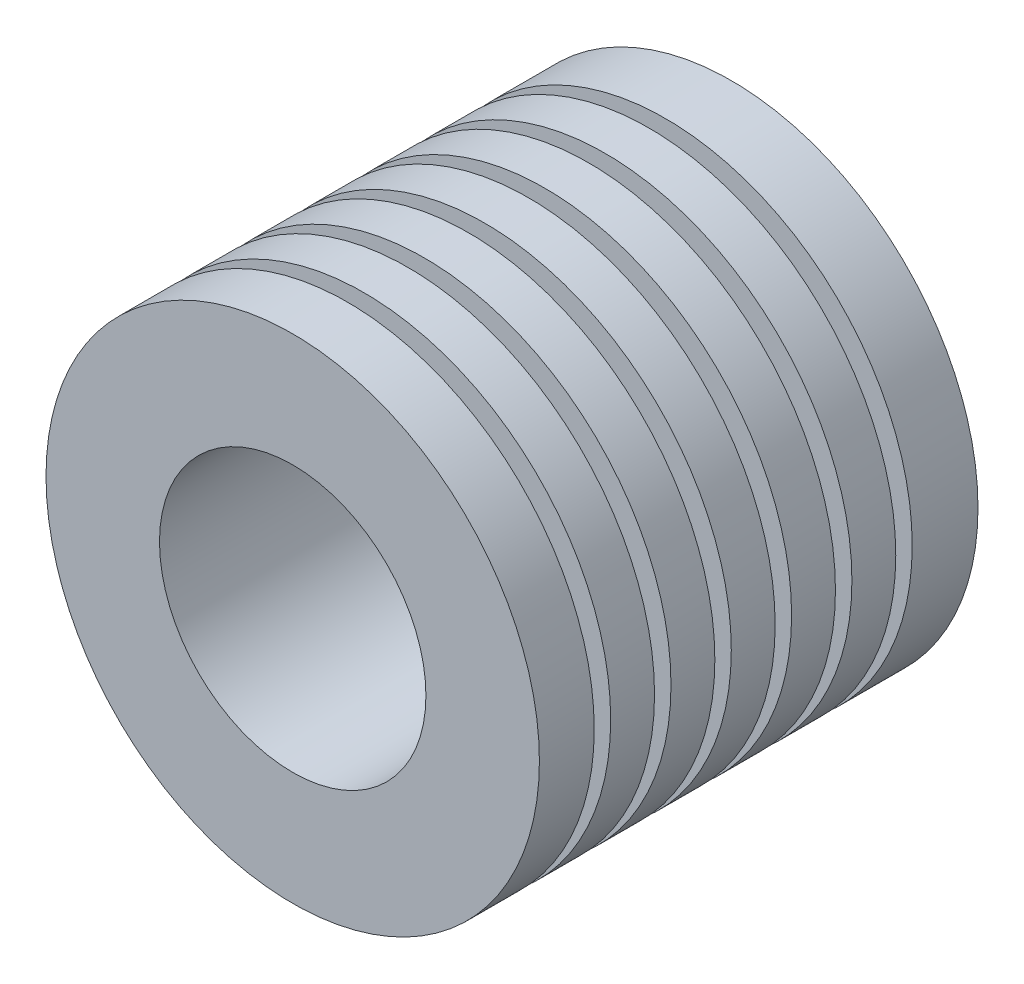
from build123d import *

# Parameters (mm, degrees)
ESQUISSE1_R                       = 22.5
BOSS_EXTRU_1_DEPTH                = 40
DIAM_TRE_DU_PER_AGE_0_15_0_15_1_D = 24.3
ESQUISSE4_W                       = 1.5
ESQUISSE4_H                       = 10
R_P_TITION_LIN_AIRE1_COUNT        = 6
R_P_TITION_LIN_AIRE1_PITCH        = 5.5
TROU_TARAUD_M31_REACH             = 53.113
TROU_TARAUD_M31_BORE_R            = 1.25
R_P_TITION_CIRCULAIRE1_COUNT      = 3


with BuildPart() as part:
    # Esquisse1 → Boss.-Extru.1 (new body)
    with BuildSketch(Plane.XY):
        Circle(ESQUISSE1_R)
    extrude(amount=BOSS_EXTRU_1_DEPTH)

    # Diam_tre du per_age _0.15 _0.15_1 (through all)
    with Locations(Plane.XY.offset(40)):
        with Locations((0, 0)):
            Hole(DIAM_TRE_DU_PER_AGE_0_15_0_15_1_D / 2)

    # Esquisse4 → Enl_vement de mati_re-R_volution1 (revolve, cut)
    with BuildSketch(Plane(origin=(0, 0, 0), x_dir=(0, 0, -1), z_dir=(1, 0, 0)), mode=Mode.PRIVATE) as enl_vement_de_mati_re_r_volution1_sk:
        with Locations((-34.25, 20)):
            Rectangle(ESQUISSE4_W, ESQUISSE4_H)
    enl_vement_de_mati_re_r_volution1 = revolve(enl_vement_de_mati_re_r_volution1_sk.sketch.rotate(Axis((0, 0, -13.444537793), (0, 0, 1)), 270), axis=Axis((0, 0, -13.444537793), (0, 0, 1)), mode=Mode.SUBTRACT)

    # R_p_tition lin_aire1: Enl_vement de mati_re-R_volution1 ×6
    with Locations(*[(0, 0, -i * R_P_TITION_LIN_AIRE1_PITCH) for i in range(1, R_P_TITION_LIN_AIRE1_COUNT)]):
        add(enl_vement_de_mati_re_r_volution1, mode=Mode.SUBTRACT)

    # Trou taraud_ M31 bore → Trou taraud_ M31 (cut, up to next)
    with BuildSketch(Plane(origin=(0, 0, 0), x_dir=(-1, 0, 0), z_dir=(0, 0, -1)), mode=Mode.PRIVATE) as trou_taraud_m31_sk1:
        with Locations((18, 0)):
            Circle(TROU_TARAUD_M31_BORE_R)
    trou_taraud_m31_tool1 = extrude(trou_taraud_m31_sk1.sketch, amount=-TROU_TARAUD_M31_REACH, mode=Mode.PRIVATE) & part.part
    trou_taraud_m31 = trou_taraud_m31_tool1.solids().sort_by_distance((-18, 0, 0))[0]
    add(trou_taraud_m31, mode=Mode.SUBTRACT)

    # R_p_tition circulaire1: Trou taraud_ M31 ×3 about axis
    r_p_tition_circulaire1_axis = Axis((0, 0, 0), (0, 0, 1))
    for i in range(1, R_P_TITION_CIRCULAIRE1_COUNT):
        add(trou_taraud_m31.rotate(r_p_tition_circulaire1_axis, i * 360 / R_P_TITION_CIRCULAIRE1_COUNT), mode=Mode.SUBTRACT)


solid = part.part
